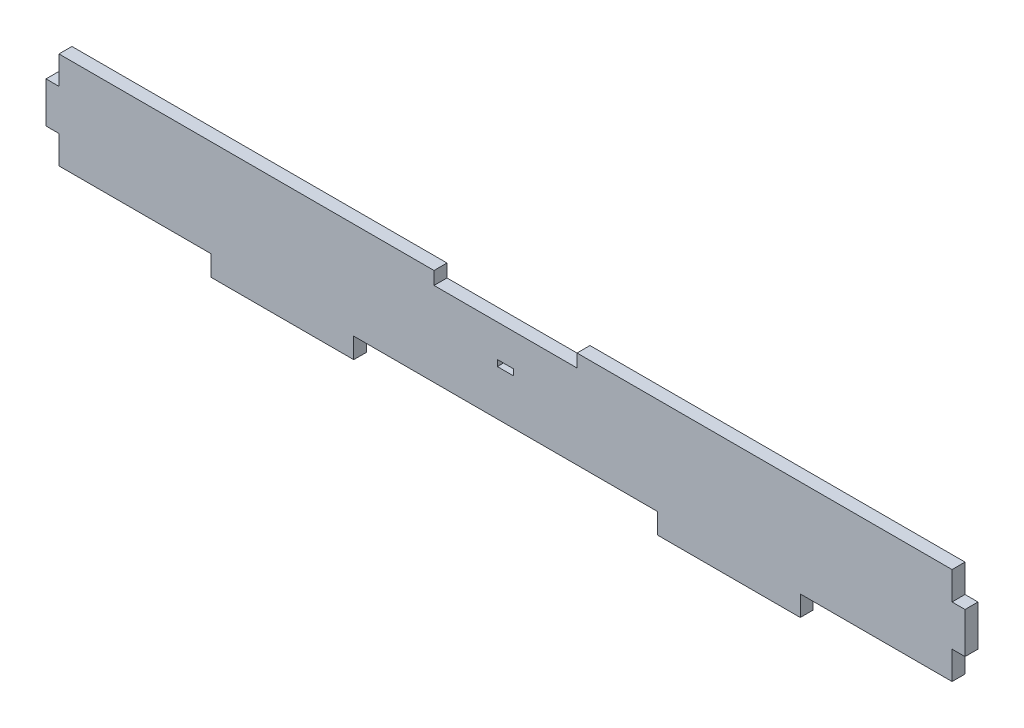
from build123d import *

# Parameters (mm, degrees)
SKETCH1_W           = 8
SKETCH1_H           = 3
BOSS_EXTRUDE1_DEPTH = 6.35


with BuildPart() as part:
    # Sketch1 → Boss-Extrude1 (new body)
    with BuildSketch(Plane.XY):
        Polygon((-35, 23.75), (-218.65, 23.75), (-218.65, 10), (-225, 10), (-225, -10), (-218.65, -10), (-218.65, -23.75), (-144.325, -23.75), (-144.325, -33.75), (-74.325, -33.75), (-74.325, -23.75), (74.325, -23.75), (74.325, -33.75), (144.325, -33.75), (144.325, -23.75), (218.65, -23.75), (218.65, -10), (225, -10), (225, 10), (218.65, 10), (218.65, 23.75), (35, 23.75), (35, 17.4), (-35, 17.4), align=None)
        Rectangle(SKETCH1_W, SKETCH1_H, mode=Mode.SUBTRACT)
    extrude(amount=BOSS_EXTRUDE1_DEPTH)


solid = part.part
